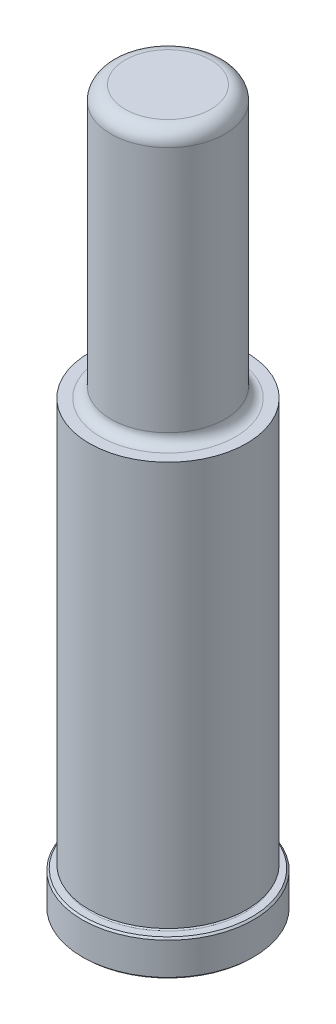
ISO-10303-21;
HEADER;
FILE_DESCRIPTION(('STEP AP214'),'2;1');
FILE_NAME('part.step','',(''),(''),'','','');
FILE_SCHEMA(('AUTOMOTIVE_DESIGN { 1 0 10303 214 1 1 1 1 }'));
ENDSEC;
DATA;
#1=APPLICATION_CONTEXT('core data for automotive mechanical design processes');
#2=APPLICATION_PROTOCOL_DEFINITION('international standard','automotive_design',2000,#1);
#3=PRODUCT_CONTEXT('',#1,'mechanical');
#4=PRODUCT('Part','Part','',(#3));
#5=PRODUCT_RELATED_PRODUCT_CATEGORY('part','',(#4));
#6=PRODUCT_DEFINITION_FORMATION('','',#4);
#7=PRODUCT_DEFINITION_CONTEXT('part definition',#1,'design');
#8=PRODUCT_DEFINITION('design','',#6,#7);
#9=PRODUCT_DEFINITION_SHAPE('','',#8);
#10=(LENGTH_UNIT() NAMED_UNIT(*) SI_UNIT(.MILLI.,.METRE.));
#11=(NAMED_UNIT(*) PLANE_ANGLE_UNIT() SI_UNIT($,.RADIAN.));
#12=(NAMED_UNIT(*) SI_UNIT($,.STERADIAN.) SOLID_ANGLE_UNIT());
#13=UNCERTAINTY_MEASURE_WITH_UNIT(LENGTH_MEASURE(1.E-05),#10,'distance_accuracy_value','');
#14=(GEOMETRIC_REPRESENTATION_CONTEXT(3) GLOBAL_UNCERTAINTY_ASSIGNED_CONTEXT((#13)) GLOBAL_UNIT_ASSIGNED_CONTEXT((#10,
#11,#12)) REPRESENTATION_CONTEXT('',''));
#15=CARTESIAN_POINT('',(0.,0.,0.));
#16=DIRECTION('',(0.,0.,1.));
#17=DIRECTION('',(1.,0.,0.));
#18=AXIS2_PLACEMENT_3D('',#15,#16,#17);
#19=CARTESIAN_POINT('',(0.,0.,0.));
#20=DIRECTION('',(0.,1.,0.));
#21=DIRECTION('',(0.,0.,1.));
#22=AXIS2_PLACEMENT_3D('',#19,#20,#21);
#23=PLANE('',#22);
#24=CARTESIAN_POINT('',(0.,0.,0.));
#25=DIRECTION('',(0.,1.,0.));
#26=DIRECTION('',(0.,0.,1.));
#27=AXIS2_PLACEMENT_3D('',#24,#25,#26);
#28=CIRCLE('',#27,18.669);
#29=CARTESIAN_POINT('',(0.,0.,18.669));
#30=VERTEX_POINT('',#29);
#31=EDGE_CURVE('E46',#30,#30,#28,.F.);
#32=ORIENTED_EDGE('',*,*,#31,.T.);
#33=EDGE_LOOP('',(#32));
#34=FACE_BOUND('',#33,.T.);
#35=ADVANCED_FACE('F31',(#34),#23,.F.);
#36=CARTESIAN_POINT('',(0.,0.,0.));
#37=DIRECTION('',(0.,1.,0.));
#38=DIRECTION('',(0.,0.,1.));
#39=AXIS2_PLACEMENT_3D('',#36,#37,#38);
#40=CYLINDRICAL_SURFACE('',#39,19.05);
#41=CARTESIAN_POINT('',(0.,0.380999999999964,0.));
#42=DIRECTION('',(0.,1.,0.));
#43=DIRECTION('',(0.,0.,1.));
#44=AXIS2_PLACEMENT_3D('',#41,#42,#43);
#45=CIRCLE('',#44,19.05);
#46=CARTESIAN_POINT('',(0.,0.380999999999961,19.05));
#47=VERTEX_POINT('',#46);
#48=EDGE_CURVE('E51',#47,#47,#45,.T.);
#49=ORIENTED_EDGE('',*,*,#48,.T.);
#50=EDGE_LOOP('',(#49));
#51=FACE_BOUND('',#50,.T.);
#52=CARTESIAN_POINT('',(0.,7.54380000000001,0.));
#53=DIRECTION('',(0.,-1.,0.));
#54=DIRECTION('',(0.,0.,-1.));
#55=AXIS2_PLACEMENT_3D('',#52,#53,#54);
#56=CIRCLE('',#55,19.05);
#57=CARTESIAN_POINT('',(0.,7.54380000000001,-19.05));
#58=VERTEX_POINT('',#57);
#59=EDGE_CURVE('E54',#58,#58,#56,.T.);
#60=ORIENTED_EDGE('',*,*,#59,.T.);
#61=EDGE_LOOP('',(#60));
#62=FACE_BOUND('',#61,.T.);
#63=ADVANCED_FACE('F110',(#51,#62),#40,.T.);
#64=CARTESIAN_POINT('',(0.,7.9248,-19.05));
#65=DIRECTION('',(0.,-1.,0.));
#66=DIRECTION('',(0.,0.,-1.));
#67=AXIS2_PLACEMENT_3D('',#64,#65,#66);
#68=PLANE('',#67);
#69=CARTESIAN_POINT('',(0.,7.9248,0.));
#70=DIRECTION('',(0.,-1.,0.));
#71=DIRECTION('',(0.,0.,-1.));
#72=AXIS2_PLACEMENT_3D('',#69,#70,#71);
#73=CIRCLE('',#72,18.669);
#74=CARTESIAN_POINT('',(0.,7.9248,-18.669));
#75=VERTEX_POINT('',#74);
#76=EDGE_CURVE('E42',#75,#75,#73,.F.);
#77=ORIENTED_EDGE('',*,*,#76,.T.);
#78=EDGE_LOOP('',(#77));
#79=FACE_BOUND('',#78,.T.);
#80=CARTESIAN_POINT('',(0.,7.9248,0.));
#81=DIRECTION('',(0.,1.,0.));
#82=DIRECTION('',(0.,0.,1.));
#83=AXIS2_PLACEMENT_3D('',#80,#81,#82);
#84=CIRCLE('',#83,17.0688);
#85=CARTESIAN_POINT('',(0.,7.92479999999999,17.0688));
#86=VERTEX_POINT('',#85);
#87=EDGE_CURVE('E57',#86,#86,#84,.T.);
#88=ORIENTED_EDGE('',*,*,#87,.F.);
#89=EDGE_LOOP('',(#88));
#90=FACE_BOUND('',#89,.T.);
#91=ADVANCED_FACE('F105',(#79,#90),#68,.F.);
#92=CARTESIAN_POINT('',(0.,8.3058,0.));
#93=DIRECTION('',(0.,1.,0.));
#94=DIRECTION('',(0.,0.,1.));
#95=AXIS2_PLACEMENT_3D('',#92,#93,#94);
#96=TOROIDAL_SURFACE('',#95,17.0688,0.381000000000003);
#97=CARTESIAN_POINT('',(0.,8.6868,0.));
#98=DIRECTION('',(0.,1.,0.));
#99=DIRECTION('',(0.,0.,1.));
#100=AXIS2_PLACEMENT_3D('',#97,#98,#99);
#101=CIRCLE('',#100,17.0688);
#102=CARTESIAN_POINT('',(0.,8.6868,17.0688));
#103=VERTEX_POINT('',#102);
#104=EDGE_CURVE('E60',#103,#103,#101,.T.);
#105=ORIENTED_EDGE('',*,*,#104,.F.);
#106=EDGE_LOOP('',(#105));
#107=FACE_BOUND('',#106,.T.);
#108=ORIENTED_EDGE('',*,*,#87,.T.);
#109=EDGE_LOOP('',(#108));
#110=FACE_BOUND('',#109,.T.);
#111=ADVANCED_FACE('F99',(#107,#110),#96,.F.);
#112=CARTESIAN_POINT('',(0.,8.6868,-17.0688));
#113=DIRECTION('',(0.,1.,0.));
#114=DIRECTION('',(0.,0.,1.));
#115=AXIS2_PLACEMENT_3D('',#112,#113,#114);
#116=PLANE('',#115);
#117=CARTESIAN_POINT('',(0.,8.6868,0.));
#118=DIRECTION('',(0.,1.,0.));
#119=DIRECTION('',(0.,0.,1.));
#120=AXIS2_PLACEMENT_3D('',#117,#118,#119);
#121=CIRCLE('',#120,17.4752);
#122=CARTESIAN_POINT('',(0.,8.6868,17.4752));
#123=VERTEX_POINT('',#122);
#124=EDGE_CURVE('E63',#123,#123,#121,.T.);
#125=ORIENTED_EDGE('',*,*,#124,.F.);
#126=EDGE_LOOP('',(#125));
#127=FACE_BOUND('',#126,.T.);
#128=ORIENTED_EDGE('',*,*,#104,.T.);
#129=EDGE_LOOP('',(#128));
#130=FACE_BOUND('',#129,.T.);
#131=ADVANCED_FACE('F93',(#127,#130),#116,.F.);
#132=CARTESIAN_POINT('',(0.,0.,0.));
#133=DIRECTION('',(0.,1.,0.));
#134=DIRECTION('',(0.,0.,1.));
#135=AXIS2_PLACEMENT_3D('',#132,#133,#134);
#136=CYLINDRICAL_SURFACE('',#135,17.4752);
#137=CARTESIAN_POINT('',(0.,98.425,0.));
#138=DIRECTION('',(0.,1.,0.));
#139=DIRECTION('',(0.,0.,1.));
#140=AXIS2_PLACEMENT_3D('',#137,#138,#139);
#141=CIRCLE('',#140,17.4752);
#142=CARTESIAN_POINT('',(0.,98.425,17.4752));
#143=VERTEX_POINT('',#142);
#144=EDGE_CURVE('E66',#143,#143,#141,.T.);
#145=ORIENTED_EDGE('',*,*,#144,.F.);
#146=EDGE_LOOP('',(#145));
#147=FACE_BOUND('',#146,.T.);
#148=ORIENTED_EDGE('',*,*,#124,.T.);
#149=EDGE_LOOP('',(#148));
#150=FACE_BOUND('',#149,.T.);
#151=ADVANCED_FACE('F87',(#147,#150),#136,.T.);
#152=CARTESIAN_POINT('',(0.,98.425,-17.4752));
#153=DIRECTION('',(0.,-1.,0.));
#154=DIRECTION('',(0.,0.,-1.));
#155=AXIS2_PLACEMENT_3D('',#152,#153,#154);
#156=PLANE('',#155);
#157=CARTESIAN_POINT('',(0.,98.425,0.));
#158=DIRECTION('',(0.,1.,0.));
#159=DIRECTION('',(0.,0.,1.));
#160=AXIS2_PLACEMENT_3D('',#157,#158,#159);
#161=CIRCLE('',#160,14.9733);
#162=CARTESIAN_POINT('',(0.,98.425,14.9733));
#163=VERTEX_POINT('',#162);
#164=EDGE_CURVE('E69',#163,#163,#161,.T.);
#165=ORIENTED_EDGE('',*,*,#164,.F.);
#166=EDGE_LOOP('',(#165));
#167=FACE_BOUND('',#166,.T.);
#168=ORIENTED_EDGE('',*,*,#144,.T.);
#169=EDGE_LOOP('',(#168));
#170=FACE_BOUND('',#169,.T.);
#171=ADVANCED_FACE('F81',(#167,#170),#156,.F.);
#172=CARTESIAN_POINT('',(0.,100.711,0.));
#173=DIRECTION('',(0.,1.,0.));
#174=DIRECTION('',(0.,0.,1.));
#175=AXIS2_PLACEMENT_3D('',#172,#173,#174);
#176=TOROIDAL_SURFACE('',#175,14.9733,2.286);
#177=CARTESIAN_POINT('',(0.,100.711,0.));
#178=DIRECTION('',(0.,1.,0.));
#179=DIRECTION('',(0.,0.,1.));
#180=AXIS2_PLACEMENT_3D('',#177,#178,#179);
#181=CIRCLE('',#180,12.6873);
#182=CARTESIAN_POINT('',(0.,100.711,12.6873));
#183=VERTEX_POINT('',#182);
#184=EDGE_CURVE('E72',#183,#183,#181,.T.);
#185=ORIENTED_EDGE('',*,*,#184,.F.);
#186=EDGE_LOOP('',(#185));
#187=FACE_BOUND('',#186,.T.);
#188=ORIENTED_EDGE('',*,*,#164,.T.);
#189=EDGE_LOOP('',(#188));
#190=FACE_BOUND('',#189,.T.);
#191=ADVANCED_FACE('F78',(#187,#190),#176,.F.);
#192=CARTESIAN_POINT('',(0.,0.,0.));
#193=DIRECTION('',(0.,1.,0.));
#194=DIRECTION('',(0.,0.,1.));
#195=AXIS2_PLACEMENT_3D('',#192,#193,#194);
#196=CYLINDRICAL_SURFACE('',#195,12.6873);
#197=CARTESIAN_POINT('',(0.,155.575,0.));
#198=DIRECTION('',(0.,-1.,0.));
#199=DIRECTION('',(0.,0.,-1.));
#200=AXIS2_PLACEMENT_3D('',#197,#198,#199);
#201=CIRCLE('',#200,12.6873);
#202=CARTESIAN_POINT('',(0.,155.575,-12.6873));
#203=VERTEX_POINT('',#202);
#204=EDGE_CURVE('E10',#203,#203,#201,.T.);
#205=ORIENTED_EDGE('',*,*,#204,.T.);
#206=EDGE_LOOP('',(#205));
#207=FACE_BOUND('',#206,.T.);
#208=ORIENTED_EDGE('',*,*,#184,.T.);
#209=EDGE_LOOP('',(#208));
#210=FACE_BOUND('',#209,.T.);
#211=ADVANCED_FACE('F76',(#207,#210),#196,.T.);
#212=CARTESIAN_POINT('',(0.,158.75,-12.6873));
#213=DIRECTION('',(0.,-1.,0.));
#214=DIRECTION('',(0.,0.,-1.));
#215=AXIS2_PLACEMENT_3D('',#212,#213,#214);
#216=PLANE('',#215);
#217=CARTESIAN_POINT('',(0.,158.75,0.));
#218=DIRECTION('',(0.,-1.,0.));
#219=DIRECTION('',(0.,0.,-1.));
#220=AXIS2_PLACEMENT_3D('',#217,#218,#219);
#221=CIRCLE('',#220,9.51230000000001);
#222=CARTESIAN_POINT('',(0.,158.75,-9.51229999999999));
#223=VERTEX_POINT('',#222);
#224=EDGE_CURVE('E38',#223,#223,#221,.F.);
#225=ORIENTED_EDGE('',*,*,#224,.T.);
#226=EDGE_LOOP('',(#225));
#227=FACE_BOUND('',#226,.T.);
#228=ADVANCED_FACE('F127',(#227),#216,.F.);
#229=CARTESIAN_POINT('',(0.,0.380999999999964,0.));
#230=DIRECTION('',(0.,1.,0.));
#231=DIRECTION('',(0.,0.,1.));
#232=AXIS2_PLACEMENT_3D('',#229,#230,#231);
#233=CONICAL_SURFACE('',#232,19.05,0.785398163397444);
#234=ORIENTED_EDGE('',*,*,#31,.F.);
#235=EDGE_LOOP('',(#234));
#236=FACE_BOUND('',#235,.T.);
#237=ORIENTED_EDGE('',*,*,#48,.F.);
#238=EDGE_LOOP('',(#237));
#239=FACE_BOUND('',#238,.T.);
#240=ADVANCED_FACE('F124',(#236,#239),#233,.T.);
#241=CARTESIAN_POINT('',(0.,7.9248,0.));
#242=DIRECTION('',(0.,-1.,0.));
#243=DIRECTION('',(0.,0.,-1.));
#244=AXIS2_PLACEMENT_3D('',#241,#242,#243);
#245=CONICAL_SURFACE('',#244,18.669,0.785398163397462);
#246=ORIENTED_EDGE('',*,*,#59,.F.);
#247=EDGE_LOOP('',(#246));
#248=FACE_BOUND('',#247,.T.);
#249=ORIENTED_EDGE('',*,*,#76,.F.);
#250=EDGE_LOOP('',(#249));
#251=FACE_BOUND('',#250,.T.);
#252=ADVANCED_FACE('F126',(#248,#251),#245,.T.);
#253=CARTESIAN_POINT('',(0.,155.575,0.));
#254=DIRECTION('',(0.,-1.,0.));
#255=DIRECTION('',(0.,0.,-1.));
#256=AXIS2_PLACEMENT_3D('',#253,#254,#255);
#257=TOROIDAL_SURFACE('',#256,9.51230000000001,3.175);
#258=ORIENTED_EDGE('',*,*,#204,.F.);
#259=EDGE_LOOP('',(#258));
#260=FACE_BOUND('',#259,.T.);
#261=ORIENTED_EDGE('',*,*,#224,.F.);
#262=EDGE_LOOP('',(#261));
#263=FACE_BOUND('',#262,.T.);
#264=ADVANCED_FACE('F33',(#260,#263),#257,.T.);
#265=CLOSED_SHELL('',(#35,#63,#91,#111,#131,#151,#171,#191,#211,#228,#240,#252,#264));
#266=MANIFOLD_SOLID_BREP('B2',#265);
#267=ADVANCED_BREP_SHAPE_REPRESENTATION('',(#18,#266),#14);
#268=SHAPE_DEFINITION_REPRESENTATION(#9,#267);
ENDSEC;
END-ISO-10303-21;
